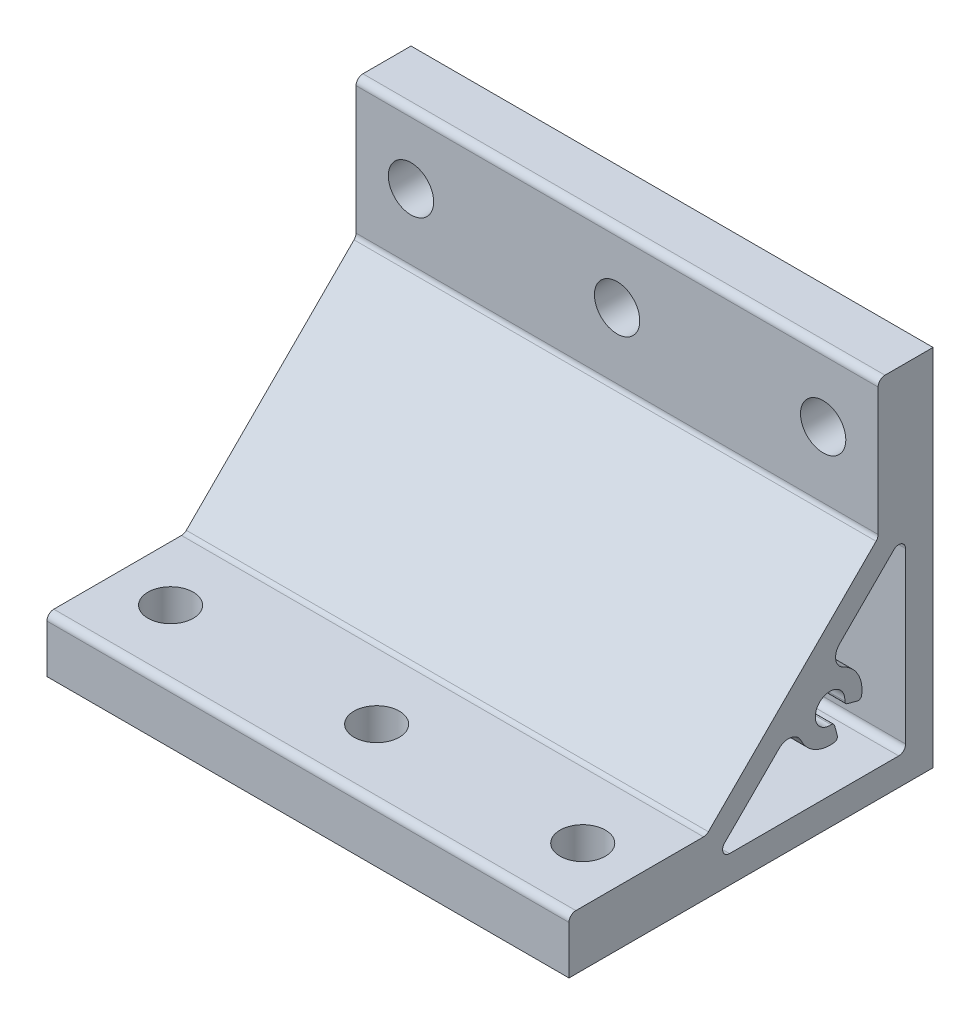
from build123d import *

# Parameters (mm, degrees)
EXTRUDE_1_DEPTH                   = 38
HOLE_WIZARD_6_6_6_6_1_D           = 6.6
HOLE_WIZARD_6_6_6_6_1_ON_FACE_2_D = 6.6


with BuildPart() as part:
    # Sketch 1 → Extrude 1 (new, symmetric)
    with BuildSketch(Plane(origin=(0, 0, 0), x_dir=(0, 0, -1), z_dir=(1, 0, 0))):
        with BuildLine():
            Line((0, 0), (0, 53))
            Line((0, 53), (-7, 53))
            ThreePointArc((-7, 53), (-7.707106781, 52.707106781), (-8, 52))
            Line((-8, 52), (-8, 33.414213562))
            ThreePointArc((-8, 33.414213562), (-8.076120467, 33.03153013), (-8.292893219, 32.707106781))
            Line((-8.292893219, 32.707106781), (-32.707106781, 8.292893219))
            ThreePointArc((-32.707106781, 8.292893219), (-33.03153013, 8.076120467), (-33.414213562, 8))
            Line((-33.414213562, 8), (-52, 8))
            ThreePointArc((-52, 8), (-52.707106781, 7.707106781), (-53, 7))
            Line((-53, 7), (-53, 0))
            Line((-53, 0), (0, 0))
        make_face()
        with BuildLine():
            Line((-29.636038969, 4), (-5, 4))
            ThreePointArc((-5, 4), (-4.292893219, 4.292893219), (-4, 5))
            Line((-4, 5), (-4, 29.636038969))
            ThreePointArc((-4, 29.636038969), (-4.617316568, 30.559918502), (-5.707106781, 30.343145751))
            Line((-5.707106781, 30.343145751), (-13.607410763, 22.442841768))
            ThreePointArc((-13.607410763, 22.442841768), (-14.162708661, 20.680742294), (-13.037348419, 19.215506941))
            ThreePointArc((-13.037348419, 19.215506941), (-10.912614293, 17.217155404), (-10.396162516, 14.346409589))
            ThreePointArc((-10.396162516, 14.346409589), (-10.615521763, 13.999552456), (-11.020608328, 13.933725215))
            Line((-11.020608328, 13.933725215), (-12.486271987, 14.326448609))
            ThreePointArc((-12.486271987, 14.326448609), (-12.764234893, 14.519501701), (-12.85556766, 14.845371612))
            ThreePointArc((-12.85556766, 14.845371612), (-16.52027958, 16.52027958), (-14.845371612, 12.85556766))
            ThreePointArc((-14.845371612, 12.85556766), (-14.519501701, 12.764234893), (-14.326448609, 12.486271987))
            Line((-14.326448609, 12.486271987), (-13.933725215, 11.020608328))
            ThreePointArc((-13.933725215, 11.020608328), (-13.999552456, 10.615521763), (-14.346409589, 10.396162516))
            ThreePointArc((-14.346409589, 10.396162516), (-17.217155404, 10.912614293), (-19.215506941, 13.037348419))
            ThreePointArc((-19.215506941, 13.037348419), (-20.680742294, 14.162708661), (-22.442841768, 13.607410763))
            Line((-22.442841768, 13.607410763), (-30.343145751, 5.707106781))
            ThreePointArc((-30.343145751, 5.707106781), (-30.559918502, 4.617316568), (-29.636038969, 4))
        make_face(mode=Mode.SUBTRACT)
    extrude(amount=EXTRUDE_1_DEPTH, both=True)

    # Hole Wizard 6.6 _6.6_ _1 (through all)
    with Locations(Plane(origin=(-30, 8, 43), x_dir=(0, 0, 1), z_dir=(0, 1, 0))):
        with Locations((0, 0), (0, 30), (0, 60)):
            Hole(HOLE_WIZARD_6_6_6_6_1_D / 2)

    # Hole Wizard 6.6 _6.6_ _1 on face 2 (through all)
    with Locations(Plane(origin=(-30, 43, 8), x_dir=(1, 0, 0), z_dir=(0, 0, 1))):
        with Locations((0, 0), (30, 0), (60, 0)):
            Hole(HOLE_WIZARD_6_6_6_6_1_ON_FACE_2_D / 2)


solid = part.part
